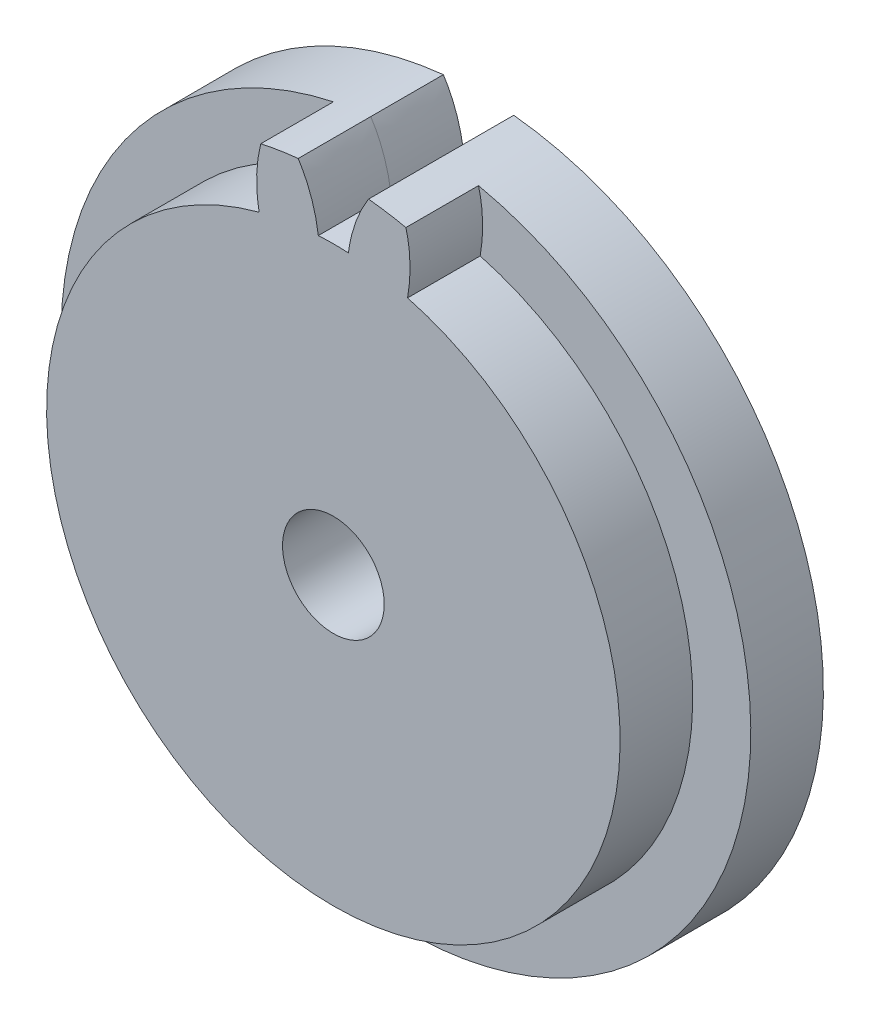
from build123d import *

# Parameters (mm, degrees)
SKETCH_3_R               = 7
EXTRUDE_1_DEPTH          = 10
EXTRUDE_START            = -10
EXTRUDE_2_DEPTH          = 10
CUT_EXTRUDE_START        = -10
SKETCH_1_R               = 7
CUT_EXTRUDE_1_DEPTH      = 10
CUT_EXTRUDE_2_DEPTH      = 10
CUT_EXTRUDE_3_DEPTH      = 72.414284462
CUT_EXTRUDE_3_DEPTH_BACK = 72.414284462
SKETCH_7_R               = 57.5
SKETCH_7_R_2             = 47.5


with BuildPart() as part:
    # Sketch 3 → Extrude 1 (new body)
    with BuildSketch(Plane.XY):
        with BuildLine():
            ThreePointArc((2.067270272, 39.445866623), (0, 39.5), (-2.067270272, 39.445866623))
            add(Edge.make_bspline(
                [(-2.067270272, 39.445866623), (-2.884023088, 45.427492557), (-6.604591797, 49.561874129)],
                knots=[0, 0, 0, 1, 1, 1], degree=2))
            ThreePointArc((-6.604591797, 49.561874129), (-7.821723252, 49.38441703), (-9.034121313, 49.177074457))
            add(Edge.make_bspline(
                [(-10.223352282, 38.154070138), (-11.294998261, 44.095324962), (-9.034121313, 49.177074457)],
                knots=[0, 0, 0, 1, 1, 1], degree=2))
            ThreePointArc((-10.223352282, 38.154070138), (-12.206171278, 37.566732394), (-14.155534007, 36.876426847))
            add(Edge.make_bspline(
                [(-14.155534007, 36.876426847), (-16.780736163, 42.312900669), (-21.596801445, 45.095212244)],
                knots=[0, 0, 0, 1, 1, 1], degree=2))
            ThreePointArc((-21.596801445, 45.095212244), (-22.699524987, 44.550326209), (-23.788511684, 43.978480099))
            add(Edge.make_bspline(
                [(-21.513241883, 33.127487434), (-24.368386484, 38.446799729), (-23.788511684, 43.978480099)],
                knots=[0, 0, 0, 1, 1, 1], degree=2))
            ThreePointArc((-21.513241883, 33.127487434), (-23.217517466, 31.956171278), (-24.858155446, 30.697265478))
            add(Edge.make_bspline(
                [(-24.858155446, 30.697265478), (-29.034833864, 35.056427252), (-34.474965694, 36.214316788)],
                knots=[0, 0, 0, 1, 1, 1], degree=2))
            ThreePointArc((-34.474965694, 36.214316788), (-35.355339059, 35.355339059), (-36.214316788, 34.474965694))
            add(Edge.make_bspline(
                [(-30.697265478, 24.858155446), (-35.056427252, 29.034833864), (-36.214316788, 34.474965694)],
                knots=[0, 0, 0, 1, 1, 1], degree=2))
            ThreePointArc((-30.697265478, 24.858155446), (-31.956171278, 23.217517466), (-33.127487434, 21.513241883))
            add(Edge.make_bspline(
                [(-33.127487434, 21.513241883), (-38.446799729, 24.368386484), (-43.978480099, 23.788511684)],
                knots=[0, 0, 0, 1, 1, 1], degree=2))
            ThreePointArc((-43.978480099, 23.788511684), (-44.550326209, 22.699524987), (-45.095212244, 21.596801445))
            add(Edge.make_bspline(
                [(-36.876426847, 14.155534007), (-42.312900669, 16.780736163), (-45.095212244, 21.596801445)],
                knots=[0, 0, 0, 1, 1, 1], degree=2))
            ThreePointArc((-36.876426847, 14.155534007), (-37.566732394, 12.206171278), (-38.154070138, 10.223352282))
            add(Edge.make_bspline(
                [(-38.154070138, 10.223352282), (-44.095324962, 11.294998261), (-49.177074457, 9.034121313)],
                knots=[0, 0, 0, 1, 1, 1], degree=2))
            ThreePointArc((-49.177074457, 9.034121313), (-49.38441703, 7.821723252), (-49.561874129, 6.604591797))
            add(Edge.make_bspline(
                [(-39.445866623, 2.067270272), (-45.427492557, 2.884023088), (-49.561874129, 6.604591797)],
                knots=[0, 0, 0, 1, 1, 1], degree=2))
            ThreePointArc((-39.445866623, 2.067270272), (-39.5, 0), (-39.445866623, -2.067270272))
            add(Edge.make_bspline(
                [(-39.445866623, -2.067270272), (-45.427492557, -2.884023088), (-49.561874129, -6.604591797)],
                knots=[0, 0, 0, 1, 1, 1], degree=2))
            ThreePointArc((-49.561874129, -6.604591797), (-49.38441703, -7.821723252), (-49.177074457, -9.034121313))
            add(Edge.make_bspline(
                [(-38.154070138, -10.223352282), (-44.095324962, -11.294998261), (-49.177074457, -9.034121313)],
                knots=[0, 0, 0, 1, 1, 1], degree=2))
            ThreePointArc((-38.154070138, -10.223352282), (-37.566732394, -12.206171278), (-36.876426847, -14.155534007))
            add(Edge.make_bspline(
                [(-36.876426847, -14.155534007), (-42.312900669, -16.780736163), (-45.095212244, -21.596801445)],
                knots=[0, 0, 0, 1, 1, 1], degree=2))
            ThreePointArc((-45.095212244, -21.596801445), (-44.550326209, -22.699524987), (-43.978480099, -23.788511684))
            add(Edge.make_bspline(
                [(-33.127487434, -21.513241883), (-38.446799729, -24.368386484), (-43.978480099, -23.788511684)],
                knots=[0, 0, 0, 1, 1, 1], degree=2))
            ThreePointArc((-33.127487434, -21.513241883), (-31.956171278, -23.217517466), (-30.697265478, -24.858155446))
            add(Edge.make_bspline(
                [(-30.697265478, -24.858155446), (-35.056427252, -29.034833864), (-36.214316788, -34.474965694)],
                knots=[0, 0, 0, 1, 1, 1], degree=2))
            ThreePointArc((-36.214316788, -34.474965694), (-35.355339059, -35.355339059), (-34.474965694, -36.214316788))
            add(Edge.make_bspline(
                [(-24.858155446, -30.697265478), (-29.034833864, -35.056427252), (-34.474965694, -36.214316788)],
                knots=[0, 0, 0, 1, 1, 1], degree=2))
            ThreePointArc((-24.858155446, -30.697265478), (-23.217517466, -31.956171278), (-21.513241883, -33.127487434))
            add(Edge.make_bspline(
                [(-21.513241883, -33.127487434), (-24.368386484, -38.446799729), (-23.788511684, -43.978480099)],
                knots=[0, 0, 0, 1, 1, 1], degree=2))
            ThreePointArc((-23.788511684, -43.978480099), (-22.699524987, -44.550326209), (-21.596801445, -45.095212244))
            add(Edge.make_bspline(
                [(-14.155534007, -36.876426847), (-16.780736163, -42.312900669), (-21.596801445, -45.095212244)],
                knots=[0, 0, 0, 1, 1, 1], degree=2))
            ThreePointArc((-14.155534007, -36.876426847), (-12.206171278, -37.566732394), (-10.223352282, -38.154070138))
            add(Edge.make_bspline(
                [(-10.223352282, -38.154070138), (-11.294998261, -44.095324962), (-9.034121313, -49.177074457)],
                knots=[0, 0, 0, 1, 1, 1], degree=2))
            ThreePointArc((-9.034121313, -49.177074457), (-7.821723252, -49.38441703), (-6.604591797, -49.561874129))
            add(Edge.make_bspline(
                [(-2.067270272, -39.445866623), (-2.884023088, -45.427492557), (-6.604591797, -49.561874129)],
                knots=[0, 0, 0, 1, 1, 1], degree=2))
            ThreePointArc((-2.067270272, -39.445866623), (0, -39.5), (2.067270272, -39.445866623))
            add(Edge.make_bspline(
                [(2.067270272, -39.445866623), (2.884023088, -45.427492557), (6.604591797, -49.561874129)],
                knots=[0, 0, 0, 1, 1, 1], degree=2))
            ThreePointArc((6.604591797, -49.561874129), (7.821723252, -49.38441703), (9.034121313, -49.177074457))
            add(Edge.make_bspline(
                [(10.223352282, -38.154070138), (11.294998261, -44.095324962), (9.034121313, -49.177074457)],
                knots=[0, 0, 0, 1, 1, 1], degree=2))
            ThreePointArc((10.223352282, -38.154070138), (12.206171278, -37.566732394), (14.155534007, -36.876426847))
            add(Edge.make_bspline(
                [(14.155534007, -36.876426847), (16.780736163, -42.312900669), (21.596801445, -45.095212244)],
                knots=[0, 0, 0, 1, 1, 1], degree=2))
            ThreePointArc((21.596801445, -45.095212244), (22.699524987, -44.550326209), (23.788511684, -43.978480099))
            add(Edge.make_bspline(
                [(21.513241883, -33.127487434), (24.368386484, -38.446799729), (23.788511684, -43.978480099)],
                knots=[0, 0, 0, 1, 1, 1], degree=2))
            ThreePointArc((21.513241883, -33.127487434), (23.217517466, -31.956171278), (24.858155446, -30.697265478))
            add(Edge.make_bspline(
                [(24.858155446, -30.697265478), (29.034833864, -35.056427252), (34.474965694, -36.214316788)],
                knots=[0, 0, 0, 1, 1, 1], degree=2))
            ThreePointArc((34.474965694, -36.214316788), (35.355339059, -35.355339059), (36.214316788, -34.474965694))
            add(Edge.make_bspline(
                [(30.697265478, -24.858155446), (35.056427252, -29.034833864), (36.214316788, -34.474965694)],
                knots=[0, 0, 0, 1, 1, 1], degree=2))
            ThreePointArc((30.697265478, -24.858155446), (31.956171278, -23.217517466), (33.127487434, -21.513241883))
            add(Edge.make_bspline(
                [(33.127487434, -21.513241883), (38.446799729, -24.368386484), (43.978480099, -23.788511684)],
                knots=[0, 0, 0, 1, 1, 1], degree=2))
            ThreePointArc((43.978480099, -23.788511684), (44.550326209, -22.699524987), (45.095212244, -21.596801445))
            add(Edge.make_bspline(
                [(36.876426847, -14.155534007), (42.312900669, -16.780736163), (45.095212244, -21.596801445)],
                knots=[0, 0, 0, 1, 1, 1], degree=2))
            ThreePointArc((36.876426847, -14.155534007), (37.566732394, -12.206171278), (38.154070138, -10.223352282))
            add(Edge.make_bspline(
                [(38.154070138, -10.223352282), (44.095324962, -11.294998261), (49.177074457, -9.034121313)],
                knots=[0, 0, 0, 1, 1, 1], degree=2))
            ThreePointArc((49.177074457, -9.034121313), (49.38441703, -7.821723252), (49.561874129, -6.604591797))
            add(Edge.make_bspline(
                [(39.445866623, -2.067270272), (45.427492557, -2.884023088), (49.561874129, -6.604591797)],
                knots=[0, 0, 0, 1, 1, 1], degree=2))
            ThreePointArc((39.445866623, -2.067270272), (39.5, 0), (39.445866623, 2.067270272))
            add(Edge.make_bspline(
                [(39.445866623, 2.067270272), (45.427492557, 2.884023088), (49.561874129, 6.604591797)],
                knots=[0, 0, 0, 1, 1, 1], degree=2))
            ThreePointArc((49.561874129, 6.604591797), (49.38441703, 7.821723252), (49.177074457, 9.034121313))
            add(Edge.make_bspline(
                [(38.154070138, 10.223352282), (44.095324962, 11.294998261), (49.177074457, 9.034121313)],
                knots=[0, 0, 0, 1, 1, 1], degree=2))
            ThreePointArc((38.154070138, 10.223352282), (37.566732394, 12.206171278), (36.876426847, 14.155534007))
            add(Edge.make_bspline(
                [(36.876426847, 14.155534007), (42.312900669, 16.780736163), (45.095212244, 21.596801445)],
                knots=[0, 0, 0, 1, 1, 1], degree=2))
            ThreePointArc((45.095212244, 21.596801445), (44.550326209, 22.699524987), (43.978480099, 23.788511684))
            add(Edge.make_bspline(
                [(33.127487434, 21.513241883), (38.446799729, 24.368386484), (43.978480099, 23.788511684)],
                knots=[0, 0, 0, 1, 1, 1], degree=2))
            ThreePointArc((33.127487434, 21.513241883), (31.956171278, 23.217517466), (30.697265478, 24.858155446))
            add(Edge.make_bspline(
                [(30.697265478, 24.858155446), (35.056427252, 29.034833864), (36.214316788, 34.474965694)],
                knots=[0, 0, 0, 1, 1, 1], degree=2))
            ThreePointArc((36.214316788, 34.474965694), (35.355339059, 35.355339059), (34.474965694, 36.214316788))
            add(Edge.make_bspline(
                [(24.858155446, 30.697265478), (29.034833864, 35.056427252), (34.474965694, 36.214316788)],
                knots=[0, 0, 0, 1, 1, 1], degree=2))
            ThreePointArc((24.858155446, 30.697265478), (23.217517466, 31.956171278), (21.513241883, 33.127487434))
            add(Edge.make_bspline(
                [(21.513241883, 33.127487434), (24.368386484, 38.446799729), (23.788511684, 43.978480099)],
                knots=[0, 0, 0, 1, 1, 1], degree=2))
            ThreePointArc((23.788511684, 43.978480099), (22.699524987, 44.550326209), (21.596801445, 45.095212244))
            add(Edge.make_bspline(
                [(14.155534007, 36.876426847), (16.780736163, 42.312900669), (21.596801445, 45.095212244)],
                knots=[0, 0, 0, 1, 1, 1], degree=2))
            ThreePointArc((14.155534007, 36.876426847), (12.206171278, 37.566732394), (10.223352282, 38.154070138))
            add(Edge.make_bspline(
                [(10.223352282, 38.154070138), (11.294998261, 44.095324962), (9.034121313, 49.177074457)],
                knots=[0, 0, 0, 1, 1, 1], degree=2))
            ThreePointArc((9.034121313, 49.177074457), (7.821723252, 49.38441703), (6.604591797, 49.561874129))
            add(Edge.make_bspline(
                [(2.067270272, 39.445866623), (2.884023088, 45.427492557), (6.604591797, 49.561874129)],
                knots=[0, 0, 0, 1, 1, 1], degree=2))
        make_face()
        Circle(SKETCH_3_R, mode=Mode.SUBTRACT)
    extrude(amount=EXTRUDE_1_DEPTH)

    # Sketch 4 → Extrude 2 (add)
    with BuildSketch(Plane.XY.offset(EXTRUDE_START)):
        with BuildLine():
            ThreePointArc((2.067270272, 39.445866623), (0, 39.5), (-2.067270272, 39.445866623))
            add(Edge.make_bspline(
                [(-2.067270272, 39.445866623), (-2.884023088, 45.427492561), (-6.604591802, 49.561874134)],
                knots=[0, 0, 0, 1, 1, 1], degree=2))
            ThreePointArc((-6.604591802, 49.561874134), (2e-09, -50.000000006), (6.604591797, 49.561874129))
            add(Edge.make_bspline(
                [(6.604591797, 49.561874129), (2.884023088, 45.427492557), (2.067270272, 39.445866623)],
                knots=[0, 0, 0, 1, 1, 1], degree=2))
        make_face()
    extrude(amount=EXTRUDE_2_DEPTH)

    # Sketch 1 → Cut-Extrude 1 (cut)
    with BuildSketch(Plane.XY.offset(CUT_EXTRUDE_START)):
        Circle(SKETCH_1_R)
    extrude(amount=CUT_EXTRUDE_1_DEPTH, mode=Mode.SUBTRACT)

    # Sketch 6 → Cut-Extrude 2 (cut)
    with BuildSketch(Plane.XY.offset(10).offset(CUT_EXTRUDE_START)):
        with BuildLine():
            ThreePointArc((23.788511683, 43.978480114), (22.699524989, 44.550326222), (21.596801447, 45.095212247))
            add(Edge.make_bspline(
                [(21.596801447, 45.095212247), (16.78073616, 42.312900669), (14.155534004, 36.876426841)],
                knots=[0, 0, 0, 1, 1, 1], degree=2))
            ThreePointArc((14.155534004, 36.876426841), (17.932624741, 35.194757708), (21.513241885, 33.127487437))
            add(Edge.make_bspline(
                [(21.513241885, 33.127487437), (24.368386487, 38.446799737), (23.788511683, 43.978480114)],
                knots=[0, 0, 0, 1, 1, 1], degree=2))
        make_face()
        with BuildLine():
            ThreePointArc((36.214316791, 34.474965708), (35.355339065, 35.35533907), (34.474965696, 36.21431679))
            add(Edge.make_bspline(
                [(34.474965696, 36.21431679), (29.034833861, 35.056427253), (24.858155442, 30.697265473)],
                knots=[0, 0, 0, 1, 1, 1], degree=2))
            ThreePointArc((24.858155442, 30.697265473), (27.930717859, 27.930717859), (30.69726548, 24.858155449))
            add(Edge.make_bspline(
                [(30.69726548, 24.858155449), (35.056427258, 29.03483387), (36.214316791, 34.474965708)],
                knots=[0, 0, 0, 1, 1, 1], degree=2))
        make_face()
        with BuildLine():
            ThreePointArc((45.095212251, 21.596801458), (44.550326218, 22.699524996), (43.978480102, 23.788511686))
            add(Edge.make_bspline(
                [(43.978480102, 23.788511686), (38.446799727, 24.368386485), (33.127487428, 21.51324188)],
                knots=[0, 0, 0, 1, 1, 1], degree=2))
            ThreePointArc((33.127487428, 21.51324188), (35.194757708, 17.932624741), (36.87642685, 14.155534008))
            add(Edge.make_bspline(
                [(36.87642685, 14.155534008), (42.312900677, 16.780736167), (45.095212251, 21.596801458)],
                knots=[0, 0, 0, 1, 1, 1], degree=2))
        make_face()
        with BuildLine():
            ThreePointArc((49.56187414, 6.604591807), (49.384417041, 7.821723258), (49.177074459, 9.034121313))
            add(Edge.make_bspline(
                [(49.177074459, 9.034121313), (44.09532496, 11.294998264), (38.154070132, 10.22335228)],
                knots=[0, 0, 0, 1, 1, 1], degree=2))
            ThreePointArc((38.154070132, 10.22335228), (39.013689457, 6.17916137), (39.445866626, 2.067270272))
            add(Edge.make_bspline(
                [(39.445866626, 2.067270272), (45.427492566, 2.884023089), (49.56187414, 6.604591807)],
                knots=[0, 0, 0, 1, 1, 1], degree=2))
        make_face()
        with BuildLine():
            ThreePointArc((49.177074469, -9.034121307), (49.384417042, -7.82172325), (49.561874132, -6.604591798))
            add(Edge.make_bspline(
                [(49.561874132, -6.604591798), (45.427492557, -2.884023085), (39.445866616, -2.067270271)],
                knots=[0, 0, 0, 1, 1, 1], degree=2))
            ThreePointArc((39.445866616, -2.067270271), (39.013689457, -6.179161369), (38.154070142, -10.223352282))
            add(Edge.make_bspline(
                [(38.154070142, -10.223352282), (44.09532497, -11.294998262), (49.177074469, -9.034121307)],
                knots=[0, 0, 0, 1, 1, 1], degree=2))
        make_face()
        with BuildLine():
            ThreePointArc((43.978480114, -23.788511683), (44.550326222, -22.699524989), (45.095212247, -21.596801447))
            add(Edge.make_bspline(
                [(45.095212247, -21.596801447), (42.312900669, -16.78073616), (36.876426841, -14.155534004)],
                knots=[0, 0, 0, 1, 1, 1], degree=2))
            ThreePointArc((36.876426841, -14.155534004), (35.194757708, -17.932624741), (33.127487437, -21.513241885))
            add(Edge.make_bspline(
                [(33.127487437, -21.513241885), (38.446799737, -24.368386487), (43.978480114, -23.788511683)],
                knots=[0, 0, 0, 1, 1, 1], degree=2))
        make_face()
        with BuildLine():
            ThreePointArc((34.474965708, -36.214316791), (35.35533907, -35.355339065), (36.21431679, -34.474965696))
            add(Edge.make_bspline(
                [(36.21431679, -34.474965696), (35.056427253, -29.034833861), (30.697265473, -24.858155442)],
                knots=[0, 0, 0, 1, 1, 1], degree=2))
            ThreePointArc((30.697265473, -24.858155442), (27.930717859, -27.930717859), (24.858155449, -30.69726548))
            add(Edge.make_bspline(
                [(24.858155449, -30.69726548), (29.03483387, -35.056427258), (34.474965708, -36.214316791)],
                knots=[0, 0, 0, 1, 1, 1], degree=2))
        make_face()
        with BuildLine():
            ThreePointArc((21.596801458, -45.095212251), (22.699524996, -44.550326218), (23.788511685, -43.978480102))
            add(Edge.make_bspline(
                [(23.788511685, -43.978480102), (24.368386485, -38.446799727), (21.51324188, -33.127487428)],
                knots=[0, 0, 0, 1, 1, 1], degree=2))
            ThreePointArc((21.51324188, -33.127487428), (17.932624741, -35.194757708), (14.155534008, -36.87642685))
            add(Edge.make_bspline(
                [(14.155534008, -36.87642685), (16.780736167, -42.312900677), (21.596801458, -45.095212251)],
                knots=[0, 0, 0, 1, 1, 1], degree=2))
        make_face()
        with BuildLine():
            ThreePointArc((6.604591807, -49.56187414), (7.821723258, -49.384417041), (9.034121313, -49.177074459))
            add(Edge.make_bspline(
                [(9.034121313, -49.177074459), (11.294998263, -44.09532496), (10.22335228, -38.154070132)],
                knots=[0, 0, 0, 1, 1, 1], degree=2))
            ThreePointArc((10.22335228, -38.154070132), (6.17916137, -39.013689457), (2.067270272, -39.445866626))
            add(Edge.make_bspline(
                [(2.067270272, -39.445866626), (2.88402309, -45.427492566), (6.604591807, -49.56187414)],
                knots=[0, 0, 0, 1, 1, 1], degree=2))
        make_face()
        with BuildLine():
            ThreePointArc((-9.034121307, -49.17707447), (-7.82172325, -49.384417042), (-6.604591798, -49.561874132))
            add(Edge.make_bspline(
                [(-6.604591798, -49.561874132), (-2.884023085, -45.427492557), (-2.067270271, -39.445866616)],
                knots=[0, 0, 0, 1, 1, 1], degree=2))
            ThreePointArc((-2.067270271, -39.445866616), (-6.179161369, -39.013689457), (-10.223352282, -38.154070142))
            add(Edge.make_bspline(
                [(-10.223352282, -38.154070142), (-11.294998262, -44.09532497), (-9.034121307, -49.17707447)],
                knots=[0, 0, 0, 1, 1, 1], degree=2))
        make_face()
        with BuildLine():
            ThreePointArc((-23.788511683, -43.978480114), (-22.699524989, -44.550326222), (-21.596801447, -45.095212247))
            add(Edge.make_bspline(
                [(-21.596801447, -45.095212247), (-16.78073616, -42.312900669), (-14.155534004, -36.876426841)],
                knots=[0, 0, 0, 1, 1, 1], degree=2))
            ThreePointArc((-14.155534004, -36.876426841), (-17.932624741, -35.194757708), (-21.513241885, -33.127487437))
            add(Edge.make_bspline(
                [(-21.513241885, -33.127487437), (-24.368386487, -38.446799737), (-23.788511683, -43.978480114)],
                knots=[0, 0, 0, 1, 1, 1], degree=2))
        make_face()
        with BuildLine():
            ThreePointArc((-36.214316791, -34.474965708), (-35.355339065, -35.35533907), (-34.474965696, -36.21431679))
            add(Edge.make_bspline(
                [(-34.474965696, -36.21431679), (-29.034833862, -35.056427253), (-24.858155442, -30.697265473)],
                knots=[0, 0, 0, 1, 1, 1], degree=2))
            ThreePointArc((-24.858155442, -30.697265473), (-27.930717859, -27.930717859), (-30.69726548, -24.858155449))
            add(Edge.make_bspline(
                [(-30.69726548, -24.858155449), (-35.056427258, -29.03483387), (-36.214316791, -34.474965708)],
                knots=[0, 0, 0, 1, 1, 1], degree=2))
        make_face()
        with BuildLine():
            ThreePointArc((-45.095212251, -21.596801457), (-44.550326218, -22.699524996), (-43.978480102, -23.788511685))
            add(Edge.make_bspline(
                [(-43.978480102, -23.788511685), (-38.446799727, -24.368386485), (-33.127487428, -21.51324188)],
                knots=[0, 0, 0, 1, 1, 1], degree=2))
            ThreePointArc((-33.127487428, -21.51324188), (-35.194757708, -17.932624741), (-36.87642685, -14.155534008))
            add(Edge.make_bspline(
                [(-36.87642685, -14.155534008), (-42.312900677, -16.780736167), (-45.095212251, -21.596801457)],
                knots=[0, 0, 0, 1, 1, 1], degree=2))
        make_face()
        with BuildLine():
            ThreePointArc((-49.56187414, -6.604591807), (-49.384417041, -7.821723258), (-49.177074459, -9.034121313))
            add(Edge.make_bspline(
                [(-49.177074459, -9.034121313), (-44.09532496, -11.294998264), (-38.154070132, -10.22335228)],
                knots=[0, 0, 0, 1, 1, 1], degree=2))
            ThreePointArc((-38.154070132, -10.22335228), (-39.013689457, -6.17916137), (-39.445866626, -2.067270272))
            add(Edge.make_bspline(
                [(-39.445866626, -2.067270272), (-45.427492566, -2.88402309), (-49.56187414, -6.604591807)],
                knots=[0, 0, 0, 1, 1, 1], degree=2))
        make_face()
        with BuildLine():
            ThreePointArc((-49.17707447, 9.034121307), (-49.384417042, 7.82172325), (-49.561874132, 6.604591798))
            add(Edge.make_bspline(
                [(-49.561874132, 6.604591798), (-45.427492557, 2.884023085), (-39.445866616, 2.067270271)],
                knots=[0, 0, 0, 1, 1, 1], degree=2))
            ThreePointArc((-39.445866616, 2.067270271), (-39.013689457, 6.179161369), (-38.154070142, 10.223352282))
            add(Edge.make_bspline(
                [(-38.154070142, 10.223352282), (-44.09532497, 11.294998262), (-49.17707447, 9.034121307)],
                knots=[0, 0, 0, 1, 1, 1], degree=2))
        make_face()
        with BuildLine():
            ThreePointArc((-43.978480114, 23.788511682), (-44.550326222, 22.699524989), (-45.095212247, 21.596801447))
            add(Edge.make_bspline(
                [(-45.095212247, 21.596801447), (-42.312900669, 16.78073616), (-36.876426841, 14.155534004)],
                knots=[0, 0, 0, 1, 1, 1], degree=2))
            ThreePointArc((-36.876426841, 14.155534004), (-35.194757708, 17.932624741), (-33.127487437, 21.513241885))
            add(Edge.make_bspline(
                [(-33.127487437, 21.513241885), (-38.446799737, 24.368386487), (-43.978480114, 23.788511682)],
                knots=[0, 0, 0, 1, 1, 1], degree=2))
        make_face()
        with BuildLine():
            ThreePointArc((-34.474965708, 36.21431679), (-35.35533907, 35.355339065), (-36.21431679, 34.474965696))
            add(Edge.make_bspline(
                [(-36.21431679, 34.474965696), (-35.056427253, 29.034833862), (-30.697265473, 24.858155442)],
                knots=[0, 0, 0, 1, 1, 1], degree=2))
            ThreePointArc((-30.697265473, 24.858155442), (-27.930717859, 27.930717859), (-24.858155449, 30.69726548))
            add(Edge.make_bspline(
                [(-24.858155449, 30.69726548), (-29.03483387, 35.056427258), (-34.474965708, 36.21431679)],
                knots=[0, 0, 0, 1, 1, 1], degree=2))
        make_face()
        with BuildLine():
            ThreePointArc((-21.596801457, 45.095212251), (-22.699524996, 44.550326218), (-23.788511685, 43.978480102))
            add(Edge.make_bspline(
                [(-23.788511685, 43.978480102), (-24.368386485, 38.446799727), (-21.51324188, 33.127487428)],
                knots=[0, 0, 0, 1, 1, 1], degree=2))
            ThreePointArc((-21.51324188, 33.127487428), (-17.932624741, 35.194757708), (-14.155534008, 36.87642685))
            add(Edge.make_bspline(
                [(-14.155534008, 36.87642685), (-16.780736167, 42.312900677), (-21.596801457, 45.095212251)],
                knots=[0, 0, 0, 1, 1, 1], degree=2))
        make_face()
    extrude(amount=CUT_EXTRUDE_2_DEPTH, mode=Mode.SUBTRACT)

    # Sketch 7 → Cut-Extrude 3 (cut, two sides: drawn at the far end of the back side and taken through both)
    with BuildSketch(Plane.XY.offset(-CUT_EXTRUDE_3_DEPTH_BACK)):
        Circle(SKETCH_7_R)
        Circle(SKETCH_7_R_2, mode=Mode.SUBTRACT)
    extrude(amount=CUT_EXTRUDE_3_DEPTH + CUT_EXTRUDE_3_DEPTH_BACK, mode=Mode.SUBTRACT)


solid = part.part
